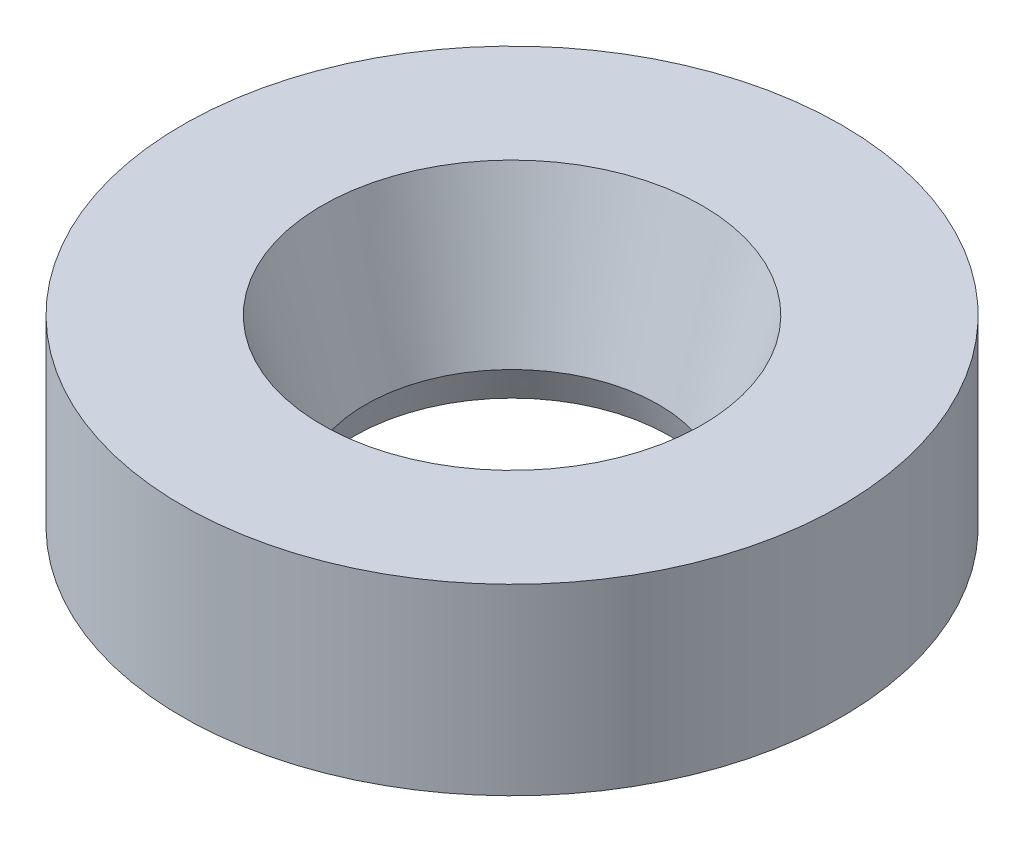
ISO-10303-21;
HEADER;
FILE_DESCRIPTION(('STEP AP214'),'2;1');
FILE_NAME('part.step','',(''),(''),'','','');
FILE_SCHEMA(('AUTOMOTIVE_DESIGN { 1 0 10303 214 1 1 1 1 }'));
ENDSEC;
DATA;
#1=APPLICATION_CONTEXT('core data for automotive mechanical design processes');
#2=APPLICATION_PROTOCOL_DEFINITION('international standard','automotive_design',2000,#1);
#3=PRODUCT_CONTEXT('',#1,'mechanical');
#4=PRODUCT('Part','Part','',(#3));
#5=PRODUCT_RELATED_PRODUCT_CATEGORY('part','',(#4));
#6=PRODUCT_DEFINITION_FORMATION('','',#4);
#7=PRODUCT_DEFINITION_CONTEXT('part definition',#1,'design');
#8=PRODUCT_DEFINITION('design','',#6,#7);
#9=PRODUCT_DEFINITION_SHAPE('','',#8);
#10=(LENGTH_UNIT() NAMED_UNIT(*) SI_UNIT(.MILLI.,.METRE.));
#11=(NAMED_UNIT(*) PLANE_ANGLE_UNIT() SI_UNIT($,.RADIAN.));
#12=(NAMED_UNIT(*) SI_UNIT($,.STERADIAN.) SOLID_ANGLE_UNIT());
#13=UNCERTAINTY_MEASURE_WITH_UNIT(LENGTH_MEASURE(1.E-05),#10,'distance_accuracy_value','');
#14=(GEOMETRIC_REPRESENTATION_CONTEXT(3) GLOBAL_UNCERTAINTY_ASSIGNED_CONTEXT((#13)) GLOBAL_UNIT_ASSIGNED_CONTEXT((#10,
#11,#12)) REPRESENTATION_CONTEXT('',''));
#15=CARTESIAN_POINT('',(0.,0.,0.));
#16=DIRECTION('',(0.,0.,1.));
#17=DIRECTION('',(1.,0.,0.));
#18=AXIS2_PLACEMENT_3D('',#15,#16,#17);
#19=CARTESIAN_POINT('',(0.,0.,0.));
#20=DIRECTION('',(0.,-1.,0.));
#21=DIRECTION('',(0.,0.,-1.));
#22=AXIS2_PLACEMENT_3D('',#19,#20,#21);
#23=CYLINDRICAL_SURFACE('',#22,8.99922);
#24=CARTESIAN_POINT('',(0.,5.00126,0.));
#25=DIRECTION('',(0.,-1.,0.));
#26=DIRECTION('',(0.,0.,-1.));
#27=AXIS2_PLACEMENT_3D('',#24,#25,#26);
#28=CIRCLE('',#27,8.99922);
#29=CARTESIAN_POINT('',(0.,5.00126,-8.99922));
#30=VERTEX_POINT('',#29);
#31=EDGE_CURVE('E47',#30,#30,#28,.T.);
#32=ORIENTED_EDGE('',*,*,#31,.T.);
#33=EDGE_LOOP('',(#32));
#34=FACE_BOUND('',#33,.T.);
#35=CARTESIAN_POINT('',(0.,0.,0.));
#36=DIRECTION('',(0.,-1.,0.));
#37=DIRECTION('',(0.,0.,-1.));
#38=AXIS2_PLACEMENT_3D('',#35,#36,#37);
#39=CIRCLE('',#38,8.99922);
#40=CARTESIAN_POINT('',(0.,0.,-8.99922));
#41=VERTEX_POINT('',#40);
#42=EDGE_CURVE('E10',#41,#41,#39,.T.);
#43=ORIENTED_EDGE('',*,*,#42,.F.);
#44=EDGE_LOOP('',(#43));
#45=FACE_BOUND('',#44,.T.);
#46=ADVANCED_FACE('F28',(#34,#45),#23,.T.);
#47=CARTESIAN_POINT('',(4.30022,0.,0.));
#48=DIRECTION('',(0.,-1.,0.));
#49=DIRECTION('',(0.,0.,-1.));
#50=AXIS2_PLACEMENT_3D('',#47,#48,#49);
#51=PLANE('',#50);
#52=ORIENTED_EDGE('',*,*,#42,.T.);
#53=EDGE_LOOP('',(#52));
#54=FACE_BOUND('',#53,.T.);
#55=CARTESIAN_POINT('',(0.,0.,0.));
#56=DIRECTION('',(0.,-1.,0.));
#57=DIRECTION('',(0.,0.,-1.));
#58=AXIS2_PLACEMENT_3D('',#55,#56,#57);
#59=CIRCLE('',#58,4.30022);
#60=CARTESIAN_POINT('',(0.,0.,-4.30022));
#61=VERTEX_POINT('',#60);
#62=EDGE_CURVE('E34',#61,#61,#59,.T.);
#63=ORIENTED_EDGE('',*,*,#62,.F.);
#64=EDGE_LOOP('',(#63));
#65=FACE_BOUND('',#64,.T.);
#66=ADVANCED_FACE('F65',(#54,#65),#51,.T.);
#67=CARTESIAN_POINT('',(0.,0.889,0.));
#68=DIRECTION('',(0.,-1.,0.));
#69=DIRECTION('',(0.,0.,-1.));
#70=AXIS2_PLACEMENT_3D('',#67,#68,#69);
#71=CONICAL_SURFACE('',#70,4.0005,0.325175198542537);
#72=ORIENTED_EDGE('',*,*,#62,.T.);
#73=EDGE_LOOP('',(#72));
#74=FACE_BOUND('',#73,.T.);
#75=CARTESIAN_POINT('',(0.,0.889,0.));
#76=DIRECTION('',(0.,-1.,0.));
#77=DIRECTION('',(0.,0.,-1.));
#78=AXIS2_PLACEMENT_3D('',#75,#76,#77);
#79=CIRCLE('',#78,4.0005);
#80=CARTESIAN_POINT('',(0.,0.889,-4.0005));
#81=VERTEX_POINT('',#80);
#82=EDGE_CURVE('E38',#81,#81,#79,.T.);
#83=ORIENTED_EDGE('',*,*,#82,.F.);
#84=EDGE_LOOP('',(#83));
#85=FACE_BOUND('',#84,.T.);
#86=ADVANCED_FACE('F61',(#74,#85),#71,.F.);
#87=CARTESIAN_POINT('',(0.,5.00126,0.));
#88=DIRECTION('',(0.,1.,0.));
#89=DIRECTION('',(0.,0.,1.));
#90=AXIS2_PLACEMENT_3D('',#87,#88,#89);
#91=CONICAL_SURFACE('',#90,5.18922,0.281396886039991);
#92=ORIENTED_EDGE('',*,*,#82,.T.);
#93=EDGE_LOOP('',(#92));
#94=FACE_BOUND('',#93,.T.);
#95=CARTESIAN_POINT('',(0.,5.00126,0.));
#96=DIRECTION('',(0.,-1.,0.));
#97=DIRECTION('',(0.,0.,-1.));
#98=AXIS2_PLACEMENT_3D('',#95,#96,#97);
#99=CIRCLE('',#98,5.18922);
#100=CARTESIAN_POINT('',(0.,5.00126,-5.18922));
#101=VERTEX_POINT('',#100);
#102=EDGE_CURVE('E42',#101,#101,#99,.T.);
#103=ORIENTED_EDGE('',*,*,#102,.F.);
#104=EDGE_LOOP('',(#103));
#105=FACE_BOUND('',#104,.T.);
#106=ADVANCED_FACE('F55',(#94,#105),#91,.F.);
#107=CARTESIAN_POINT('',(8.99922,5.00126,0.));
#108=DIRECTION('',(0.,1.,0.));
#109=DIRECTION('',(0.,0.,1.));
#110=AXIS2_PLACEMENT_3D('',#107,#108,#109);
#111=PLANE('',#110);
#112=ORIENTED_EDGE('',*,*,#102,.T.);
#113=EDGE_LOOP('',(#112));
#114=FACE_BOUND('',#113,.T.);
#115=ORIENTED_EDGE('',*,*,#31,.F.);
#116=EDGE_LOOP('',(#115));
#117=FACE_BOUND('',#116,.T.);
#118=ADVANCED_FACE('F53',(#114,#117),#111,.T.);
#119=CLOSED_SHELL('',(#46,#66,#86,#106,#118));
#120=MANIFOLD_SOLID_BREP('B2',#119);
#121=ADVANCED_BREP_SHAPE_REPRESENTATION('',(#18,#120),#14);
#122=SHAPE_DEFINITION_REPRESENTATION(#9,#121);
ENDSEC;
END-ISO-10303-21;
